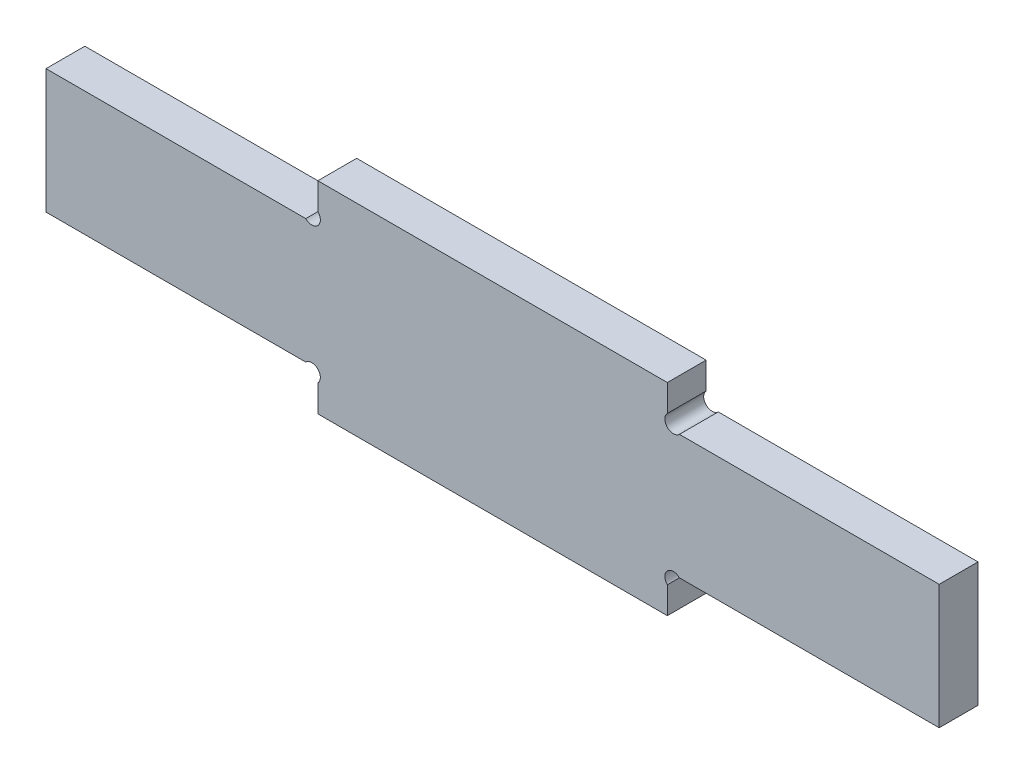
ISO-10303-21;
HEADER;
FILE_DESCRIPTION(('STEP AP214'),'2;1');
FILE_NAME('part.step','',(''),(''),'','','');
FILE_SCHEMA(('AUTOMOTIVE_DESIGN { 1 0 10303 214 1 1 1 1 }'));
ENDSEC;
DATA;
#1=APPLICATION_CONTEXT('core data for automotive mechanical design processes');
#2=APPLICATION_PROTOCOL_DEFINITION('international standard','automotive_design',2000,#1);
#3=PRODUCT_CONTEXT('',#1,'mechanical');
#4=PRODUCT('Part','Part','',(#3));
#5=PRODUCT_RELATED_PRODUCT_CATEGORY('part','',(#4));
#6=PRODUCT_DEFINITION_FORMATION('','',#4);
#7=PRODUCT_DEFINITION_CONTEXT('part definition',#1,'design');
#8=PRODUCT_DEFINITION('design','',#6,#7);
#9=PRODUCT_DEFINITION_SHAPE('','',#8);
#10=(LENGTH_UNIT() NAMED_UNIT(*) SI_UNIT(.MILLI.,.METRE.));
#11=(NAMED_UNIT(*) PLANE_ANGLE_UNIT() SI_UNIT($,.RADIAN.));
#12=(NAMED_UNIT(*) SI_UNIT($,.STERADIAN.) SOLID_ANGLE_UNIT());
#13=UNCERTAINTY_MEASURE_WITH_UNIT(LENGTH_MEASURE(1.E-05),#10,'distance_accuracy_value','');
#14=(GEOMETRIC_REPRESENTATION_CONTEXT(3) GLOBAL_UNCERTAINTY_ASSIGNED_CONTEXT((#13)) GLOBAL_UNIT_ASSIGNED_CONTEXT((#10,
#11,#12)) REPRESENTATION_CONTEXT('',''));
#15=CARTESIAN_POINT('',(0.,0.,0.));
#16=DIRECTION('',(0.,0.,1.));
#17=DIRECTION('',(1.,0.,0.));
#18=AXIS2_PLACEMENT_3D('',#15,#16,#17);
#19=CARTESIAN_POINT('',(0.,26.,5.));
#20=DIRECTION('',(0.,0.,-1.));
#21=DIRECTION('',(-1.,0.,0.));
#22=AXIS2_PLACEMENT_3D('',#19,#20,#21);
#23=PLANE('',#22);
#24=DIRECTION('',(0.,1.,0.));
#25=VECTOR('',#24,1.);
#26=CARTESIAN_POINT('',(80.,0.,5.));
#27=LINE('',#26,#25);
#28=CARTESIAN_POINT('',(80.,0.,5.));
#29=VERTEX_POINT('',#28);
#30=CARTESIAN_POINT('',(80.,3.44436508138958,5.));
#31=VERTEX_POINT('',#30);
#32=EDGE_CURVE('E50',#29,#31,#27,.T.);
#33=ORIENTED_EDGE('',*,*,#32,.T.);
#34=CARTESIAN_POINT('',(80.7778174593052,4.22218254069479,5.));
#35=DIRECTION('',(0.,0.,-1.));
#36=DIRECTION('',(-1.,0.,0.));
#37=AXIS2_PLACEMENT_3D('',#34,#35,#36);
#38=CIRCLE('',#37,1.1);
#39=CARTESIAN_POINT('',(81.5556349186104,5.,5.));
#40=VERTEX_POINT('',#39);
#41=EDGE_CURVE('E161',#31,#40,#38,.T.);
#42=ORIENTED_EDGE('',*,*,#41,.T.);
#43=DIRECTION('',(1.,0.,0.));
#44=VECTOR('',#43,1.);
#45=CARTESIAN_POINT('',(115.,5.,5.));
#46=LINE('',#45,#44);
#47=CARTESIAN_POINT('',(115.,5.,5.));
#48=VERTEX_POINT('',#47);
#49=EDGE_CURVE('E170',#40,#48,#46,.T.);
#50=ORIENTED_EDGE('',*,*,#49,.T.);
#51=DIRECTION('',(0.,-1.,0.));
#52=VECTOR('',#51,1.);
#53=CARTESIAN_POINT('',(115.,0.,5.));
#54=LINE('',#53,#52);
#55=CARTESIAN_POINT('',(115.,21.,5.));
#56=VERTEX_POINT('',#55);
#57=EDGE_CURVE('E198',#56,#48,#54,.T.);
#58=ORIENTED_EDGE('',*,*,#57,.F.);
#59=DIRECTION('',(-1.,0.,0.));
#60=VECTOR('',#59,1.);
#61=CARTESIAN_POINT('',(115.,21.,5.));
#62=LINE('',#61,#60);
#63=CARTESIAN_POINT('',(81.5556349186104,21.,5.));
#64=VERTEX_POINT('',#63);
#65=EDGE_CURVE('E58',#56,#64,#62,.T.);
#66=ORIENTED_EDGE('',*,*,#65,.T.);
#67=CARTESIAN_POINT('',(80.7778174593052,21.7778174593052,5.));
#68=DIRECTION('',(0.,0.,-1.));
#69=DIRECTION('',(-1.,0.,0.));
#70=AXIS2_PLACEMENT_3D('',#67,#68,#69);
#71=CIRCLE('',#70,1.1);
#72=CARTESIAN_POINT('',(80.,22.5556349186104,5.));
#73=VERTEX_POINT('',#72);
#74=EDGE_CURVE('E174',#64,#73,#71,.T.);
#75=ORIENTED_EDGE('',*,*,#74,.T.);
#76=DIRECTION('',(0.,1.,0.));
#77=VECTOR('',#76,1.);
#78=CARTESIAN_POINT('',(80.,26.,5.));
#79=LINE('',#78,#77);
#80=CARTESIAN_POINT('',(80.,26.,5.));
#81=VERTEX_POINT('',#80);
#82=EDGE_CURVE('E189',#73,#81,#79,.T.);
#83=ORIENTED_EDGE('',*,*,#82,.T.);
#84=DIRECTION('',(-1.,0.,0.));
#85=VECTOR('',#84,1.);
#86=CARTESIAN_POINT('',(0.,26.,5.));
#87=LINE('',#86,#85);
#88=CARTESIAN_POINT('',(35.,26.,5.));
#89=VERTEX_POINT('',#88);
#90=EDGE_CURVE('E11',#81,#89,#87,.T.);
#91=ORIENTED_EDGE('',*,*,#90,.T.);
#92=DIRECTION('',(0.,1.,0.));
#93=VECTOR('',#92,1.);
#94=CARTESIAN_POINT('',(35.,26.,5.));
#95=LINE('',#94,#93);
#96=CARTESIAN_POINT('',(35.,22.5556349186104,5.));
#97=VERTEX_POINT('',#96);
#98=EDGE_CURVE('E241',#97,#89,#95,.T.);
#99=ORIENTED_EDGE('',*,*,#98,.F.);
#100=CARTESIAN_POINT('',(34.2221825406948,21.7778174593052,5.));
#101=DIRECTION('',(0.,0.,1.));
#102=DIRECTION('',(1.,0.,0.));
#103=AXIS2_PLACEMENT_3D('',#100,#101,#102);
#104=CIRCLE('',#103,1.1);
#105=CARTESIAN_POINT('',(33.4443650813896,21.,5.));
#106=VERTEX_POINT('',#105);
#107=EDGE_CURVE('E216',#106,#97,#104,.T.);
#108=ORIENTED_EDGE('',*,*,#107,.F.);
#109=DIRECTION('',(1.,0.,0.));
#110=VECTOR('',#109,1.);
#111=CARTESIAN_POINT('',(0.,21.,5.));
#112=LINE('',#111,#110);
#113=CARTESIAN_POINT('',(0.,21.,5.));
#114=VERTEX_POINT('',#113);
#115=EDGE_CURVE('E238',#114,#106,#112,.T.);
#116=ORIENTED_EDGE('',*,*,#115,.F.);
#117=DIRECTION('',(0.,-1.,0.));
#118=VECTOR('',#117,1.);
#119=CARTESIAN_POINT('',(0.,0.,5.));
#120=LINE('',#119,#118);
#121=CARTESIAN_POINT('',(0.,5.,5.));
#122=VERTEX_POINT('',#121);
#123=EDGE_CURVE('E253',#114,#122,#120,.T.);
#124=ORIENTED_EDGE('',*,*,#123,.T.);
#125=DIRECTION('',(-1.,0.,0.));
#126=VECTOR('',#125,1.);
#127=CARTESIAN_POINT('',(0.,5.,5.));
#128=LINE('',#127,#126);
#129=CARTESIAN_POINT('',(33.4443650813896,5.,5.));
#130=VERTEX_POINT('',#129);
#131=EDGE_CURVE('E228',#130,#122,#128,.T.);
#132=ORIENTED_EDGE('',*,*,#131,.F.);
#133=CARTESIAN_POINT('',(34.2221825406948,4.22218254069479,5.));
#134=DIRECTION('',(0.,0.,1.));
#135=DIRECTION('',(1.,0.,0.));
#136=AXIS2_PLACEMENT_3D('',#133,#134,#135);
#137=CIRCLE('',#136,1.1);
#138=CARTESIAN_POINT('',(35.,3.44436508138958,5.));
#139=VERTEX_POINT('',#138);
#140=EDGE_CURVE('E210',#139,#130,#137,.T.);
#141=ORIENTED_EDGE('',*,*,#140,.F.);
#142=DIRECTION('',(0.,1.,0.));
#143=VECTOR('',#142,1.);
#144=CARTESIAN_POINT('',(35.,0.,5.));
#145=LINE('',#144,#143);
#146=CARTESIAN_POINT('',(35.,0.,5.));
#147=VERTEX_POINT('',#146);
#148=EDGE_CURVE('E225',#147,#139,#145,.T.);
#149=ORIENTED_EDGE('',*,*,#148,.F.);
#150=DIRECTION('',(1.,0.,0.));
#151=VECTOR('',#150,1.);
#152=CARTESIAN_POINT('',(0.,0.,5.));
#153=LINE('',#152,#151);
#154=EDGE_CURVE('E42',#147,#29,#153,.T.);
#155=ORIENTED_EDGE('',*,*,#154,.T.);
#156=EDGE_LOOP('',(#33,#42,#50,#58,#66,#75,#83,#91,#99,#108,#116,#124,#132,#141,#149,#155));
#157=FACE_BOUND('',#156,.T.);
#158=ADVANCED_FACE('F33',(#157),#23,.F.);
#159=CARTESIAN_POINT('',(0.,26.,0.));
#160=DIRECTION('',(0.,0.,-1.));
#161=DIRECTION('',(-1.,0.,0.));
#162=AXIS2_PLACEMENT_3D('',#159,#160,#161);
#163=PLANE('',#162);
#164=CARTESIAN_POINT('',(80.7778174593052,4.22218254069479,0.));
#165=DIRECTION('',(0.,0.,-1.));
#166=DIRECTION('',(-1.,0.,0.));
#167=AXIS2_PLACEMENT_3D('',#164,#165,#166);
#168=CIRCLE('',#167,1.1);
#169=CARTESIAN_POINT('',(80.,3.44436508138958,0.));
#170=VERTEX_POINT('',#169);
#171=CARTESIAN_POINT('',(81.5556349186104,5.,0.));
#172=VERTEX_POINT('',#171);
#173=EDGE_CURVE('E149',#170,#172,#168,.T.);
#174=ORIENTED_EDGE('',*,*,#173,.F.);
#175=DIRECTION('',(0.,1.,0.));
#176=VECTOR('',#175,1.);
#177=CARTESIAN_POINT('',(80.,0.,0.));
#178=LINE('',#177,#176);
#179=CARTESIAN_POINT('',(80.,0.,0.));
#180=VERTEX_POINT('',#179);
#181=EDGE_CURVE('E154',#180,#170,#178,.T.);
#182=ORIENTED_EDGE('',*,*,#181,.F.);
#183=DIRECTION('',(1.,0.,0.));
#184=VECTOR('',#183,1.);
#185=CARTESIAN_POINT('',(0.,0.,0.));
#186=LINE('',#185,#184);
#187=CARTESIAN_POINT('',(35.,0.,0.));
#188=VERTEX_POINT('',#187);
#189=EDGE_CURVE('E259',#188,#180,#186,.T.);
#190=ORIENTED_EDGE('',*,*,#189,.F.);
#191=DIRECTION('',(0.,1.,0.));
#192=VECTOR('',#191,1.);
#193=CARTESIAN_POINT('',(35.,0.,0.));
#194=LINE('',#193,#192);
#195=CARTESIAN_POINT('',(35.,3.44436508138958,0.));
#196=VERTEX_POINT('',#195);
#197=EDGE_CURVE('E220',#188,#196,#194,.T.);
#198=ORIENTED_EDGE('',*,*,#197,.T.);
#199=CARTESIAN_POINT('',(34.2221825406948,4.22218254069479,0.));
#200=DIRECTION('',(0.,0.,-1.));
#201=DIRECTION('',(-1.,0.,0.));
#202=AXIS2_PLACEMENT_3D('',#199,#200,#201);
#203=CIRCLE('',#202,1.1);
#204=CARTESIAN_POINT('',(33.4443650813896,5.,0.));
#205=VERTEX_POINT('',#204);
#206=EDGE_CURVE('E212',#196,#205,#203,.F.);
#207=ORIENTED_EDGE('',*,*,#206,.T.);
#208=DIRECTION('',(-1.,0.,0.));
#209=VECTOR('',#208,1.);
#210=CARTESIAN_POINT('',(0.,5.,0.));
#211=LINE('',#210,#209);
#212=CARTESIAN_POINT('',(0.,5.,0.));
#213=VERTEX_POINT('',#212);
#214=EDGE_CURVE('E223',#205,#213,#211,.T.);
#215=ORIENTED_EDGE('',*,*,#214,.T.);
#216=DIRECTION('',(0.,-1.,0.));
#217=VECTOR('',#216,1.);
#218=CARTESIAN_POINT('',(0.,0.,0.));
#219=LINE('',#218,#217);
#220=CARTESIAN_POINT('',(0.,21.,0.));
#221=VERTEX_POINT('',#220);
#222=EDGE_CURVE('E252',#221,#213,#219,.T.);
#223=ORIENTED_EDGE('',*,*,#222,.F.);
#224=DIRECTION('',(1.,0.,0.));
#225=VECTOR('',#224,1.);
#226=CARTESIAN_POINT('',(0.,21.,0.));
#227=LINE('',#226,#225);
#228=CARTESIAN_POINT('',(33.4443650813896,21.,0.));
#229=VERTEX_POINT('',#228);
#230=EDGE_CURVE('E248',#221,#229,#227,.T.);
#231=ORIENTED_EDGE('',*,*,#230,.T.);
#232=CARTESIAN_POINT('',(34.2221825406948,21.7778174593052,0.));
#233=DIRECTION('',(0.,0.,-1.));
#234=DIRECTION('',(-1.,0.,0.));
#235=AXIS2_PLACEMENT_3D('',#232,#233,#234);
#236=CIRCLE('',#235,1.1);
#237=CARTESIAN_POINT('',(35.,22.5556349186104,0.));
#238=VERTEX_POINT('',#237);
#239=EDGE_CURVE('E218',#229,#238,#236,.F.);
#240=ORIENTED_EDGE('',*,*,#239,.T.);
#241=DIRECTION('',(0.,1.,0.));
#242=VECTOR('',#241,1.);
#243=CARTESIAN_POINT('',(35.,26.,0.));
#244=LINE('',#243,#242);
#245=CARTESIAN_POINT('',(35.,26.,0.));
#246=VERTEX_POINT('',#245);
#247=EDGE_CURVE('E234',#238,#246,#244,.T.);
#248=ORIENTED_EDGE('',*,*,#247,.T.);
#249=DIRECTION('',(-1.,0.,0.));
#250=VECTOR('',#249,1.);
#251=CARTESIAN_POINT('',(0.,26.,0.));
#252=LINE('',#251,#250);
#253=CARTESIAN_POINT('',(80.,26.,0.));
#254=VERTEX_POINT('',#253);
#255=EDGE_CURVE('E37',#254,#246,#252,.T.);
#256=ORIENTED_EDGE('',*,*,#255,.F.);
#257=DIRECTION('',(0.,1.,0.));
#258=VECTOR('',#257,1.);
#259=CARTESIAN_POINT('',(80.,26.,0.));
#260=LINE('',#259,#258);
#261=CARTESIAN_POINT('',(80.,22.5556349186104,0.));
#262=VERTEX_POINT('',#261);
#263=EDGE_CURVE('E184',#262,#254,#260,.T.);
#264=ORIENTED_EDGE('',*,*,#263,.F.);
#265=CARTESIAN_POINT('',(80.7778174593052,21.7778174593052,0.));
#266=DIRECTION('',(0.,0.,-1.));
#267=DIRECTION('',(-1.,0.,0.));
#268=AXIS2_PLACEMENT_3D('',#265,#266,#267);
#269=CIRCLE('',#268,1.1);
#270=CARTESIAN_POINT('',(81.5556349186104,21.,0.));
#271=VERTEX_POINT('',#270);
#272=EDGE_CURVE('E171',#271,#262,#269,.T.);
#273=ORIENTED_EDGE('',*,*,#272,.F.);
#274=DIRECTION('',(-1.,0.,0.));
#275=VECTOR('',#274,1.);
#276=CARTESIAN_POINT('',(115.,21.,0.));
#277=LINE('',#276,#275);
#278=CARTESIAN_POINT('',(115.,21.,0.));
#279=VERTEX_POINT('',#278);
#280=EDGE_CURVE('E186',#279,#271,#277,.T.);
#281=ORIENTED_EDGE('',*,*,#280,.F.);
#282=DIRECTION('',(0.,-1.,0.));
#283=VECTOR('',#282,1.);
#284=CARTESIAN_POINT('',(115.,0.,0.));
#285=LINE('',#284,#283);
#286=CARTESIAN_POINT('',(115.,5.,0.));
#287=VERTEX_POINT('',#286);
#288=EDGE_CURVE('E195',#279,#287,#285,.T.);
#289=ORIENTED_EDGE('',*,*,#288,.T.);
#290=DIRECTION('',(1.,0.,0.));
#291=VECTOR('',#290,1.);
#292=CARTESIAN_POINT('',(115.,5.,0.));
#293=LINE('',#292,#291);
#294=EDGE_CURVE('E157',#172,#287,#293,.T.);
#295=ORIENTED_EDGE('',*,*,#294,.F.);
#296=EDGE_LOOP('',(#174,#182,#190,#198,#207,#215,#223,#231,#240,#248,#256,#264,#273,#281,#289,#295));
#297=FACE_BOUND('',#296,.T.);
#298=ADVANCED_FACE('F151',(#297),#163,.T.);
#299=CARTESIAN_POINT('',(80.,0.,-0.00100000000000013));
#300=DIRECTION('',(1.,0.,0.));
#301=DIRECTION('',(0.,0.,-1.));
#302=AXIS2_PLACEMENT_3D('',#299,#300,#301);
#303=PLANE('',#302);
#304=ORIENTED_EDGE('',*,*,#181,.T.);
#305=DIRECTION('',(0.,0.,1.));
#306=VECTOR('',#305,1.);
#307=CARTESIAN_POINT('',(80.,3.44436508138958,-0.00100000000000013));
#308=LINE('',#307,#306);
#309=EDGE_CURVE('E163',#31,#170,#308,.F.);
#310=ORIENTED_EDGE('',*,*,#309,.F.);
#311=ORIENTED_EDGE('',*,*,#32,.F.);
#312=DIRECTION('',(0.,0.,1.));
#313=VECTOR('',#312,1.);
#314=CARTESIAN_POINT('',(80.,0.,-0.00100000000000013));
#315=LINE('',#314,#313);
#316=EDGE_CURVE('E169',#180,#29,#315,.T.);
#317=ORIENTED_EDGE('',*,*,#316,.F.);
#318=EDGE_LOOP('',(#304,#310,#311,#317));
#319=FACE_BOUND('',#318,.T.);
#320=ADVANCED_FACE('F168',(#319),#303,.T.);
#321=CARTESIAN_POINT('',(115.,21.,-0.00100000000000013));
#322=DIRECTION('',(0.,1.,0.));
#323=DIRECTION('',(0.,0.,1.));
#324=AXIS2_PLACEMENT_3D('',#321,#322,#323);
#325=PLANE('',#324);
#326=ORIENTED_EDGE('',*,*,#280,.T.);
#327=DIRECTION('',(0.,0.,1.));
#328=VECTOR('',#327,1.);
#329=CARTESIAN_POINT('',(81.5556349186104,21.,-0.00100000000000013));
#330=LINE('',#329,#328);
#331=EDGE_CURVE('E166',#64,#271,#330,.F.);
#332=ORIENTED_EDGE('',*,*,#331,.F.);
#333=ORIENTED_EDGE('',*,*,#65,.F.);
#334=DIRECTION('',(0.,0.,1.));
#335=VECTOR('',#334,1.);
#336=CARTESIAN_POINT('',(115.,21.,-0.00100000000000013));
#337=LINE('',#336,#335);
#338=EDGE_CURVE('E193',#279,#56,#337,.T.);
#339=ORIENTED_EDGE('',*,*,#338,.F.);
#340=EDGE_LOOP('',(#326,#332,#333,#339));
#341=FACE_BOUND('',#340,.T.);
#342=ADVANCED_FACE('F289',(#341),#325,.T.);
#343=CARTESIAN_POINT('',(115.,5.,-0.00100000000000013));
#344=DIRECTION('',(0.,-1.,0.));
#345=DIRECTION('',(0.,0.,-1.));
#346=AXIS2_PLACEMENT_3D('',#343,#344,#345);
#347=PLANE('',#346);
#348=ORIENTED_EDGE('',*,*,#49,.F.);
#349=DIRECTION('',(0.,0.,1.));
#350=VECTOR('',#349,1.);
#351=CARTESIAN_POINT('',(81.5556349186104,5.,-0.00100000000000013));
#352=LINE('',#351,#350);
#353=EDGE_CURVE('E287',#172,#40,#352,.T.);
#354=ORIENTED_EDGE('',*,*,#353,.F.);
#355=ORIENTED_EDGE('',*,*,#294,.T.);
#356=DIRECTION('',(0.,0.,1.));
#357=VECTOR('',#356,1.);
#358=CARTESIAN_POINT('',(115.,5.,-0.00100000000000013));
#359=LINE('',#358,#357);
#360=EDGE_CURVE('E179',#287,#48,#359,.T.);
#361=ORIENTED_EDGE('',*,*,#360,.T.);
#362=EDGE_LOOP('',(#348,#354,#355,#361));
#363=FACE_BOUND('',#362,.T.);
#364=ADVANCED_FACE('F296',(#363),#347,.T.);
#365=CARTESIAN_POINT('',(80.,26.,-0.00100000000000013));
#366=DIRECTION('',(1.,0.,0.));
#367=DIRECTION('',(0.,0.,-1.));
#368=AXIS2_PLACEMENT_3D('',#365,#366,#367);
#369=PLANE('',#368);
#370=ORIENTED_EDGE('',*,*,#82,.F.);
#371=DIRECTION('',(0.,0.,1.));
#372=VECTOR('',#371,1.);
#373=CARTESIAN_POINT('',(80.,22.5556349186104,-0.00100000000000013));
#374=LINE('',#373,#372);
#375=EDGE_CURVE('E160',#262,#73,#374,.T.);
#376=ORIENTED_EDGE('',*,*,#375,.F.);
#377=ORIENTED_EDGE('',*,*,#263,.T.);
#378=DIRECTION('',(0.,0.,1.));
#379=VECTOR('',#378,1.);
#380=CARTESIAN_POINT('',(80.,26.,-0.00100000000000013));
#381=LINE('',#380,#379);
#382=EDGE_CURVE('E192',#254,#81,#381,.T.);
#383=ORIENTED_EDGE('',*,*,#382,.T.);
#384=EDGE_LOOP('',(#370,#376,#377,#383));
#385=FACE_BOUND('',#384,.T.);
#386=ADVANCED_FACE('F281',(#385),#369,.T.);
#387=CARTESIAN_POINT('',(115.,0.,5.));
#388=DIRECTION('',(1.,0.,0.));
#389=DIRECTION('',(0.,0.,-1.));
#390=AXIS2_PLACEMENT_3D('',#387,#388,#389);
#391=PLANE('',#390);
#392=ORIENTED_EDGE('',*,*,#57,.T.);
#393=ORIENTED_EDGE('',*,*,#360,.F.);
#394=ORIENTED_EDGE('',*,*,#288,.F.);
#395=ORIENTED_EDGE('',*,*,#338,.T.);
#396=EDGE_LOOP('',(#392,#393,#394,#395));
#397=FACE_BOUND('',#396,.T.);
#398=ADVANCED_FACE('F292',(#397),#391,.T.);
#399=CARTESIAN_POINT('',(0.,0.,5.));
#400=DIRECTION('',(0.,1.,0.));
#401=DIRECTION('',(0.,0.,1.));
#402=AXIS2_PLACEMENT_3D('',#399,#400,#401);
#403=PLANE('',#402);
#404=ORIENTED_EDGE('',*,*,#316,.T.);
#405=ORIENTED_EDGE('',*,*,#154,.F.);
#406=DIRECTION('',(0.,0.,1.));
#407=VECTOR('',#406,1.);
#408=CARTESIAN_POINT('',(35.,0.,-0.00100000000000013));
#409=LINE('',#408,#407);
#410=EDGE_CURVE('E230',#188,#147,#409,.T.);
#411=ORIENTED_EDGE('',*,*,#410,.F.);
#412=ORIENTED_EDGE('',*,*,#189,.T.);
#413=EDGE_LOOP('',(#404,#405,#411,#412));
#414=FACE_BOUND('',#413,.T.);
#415=ADVANCED_FACE('F320',(#414),#403,.F.);
#416=CARTESIAN_POINT('',(0.,26.,5.));
#417=DIRECTION('',(0.,-1.,0.));
#418=DIRECTION('',(0.,0.,-1.));
#419=AXIS2_PLACEMENT_3D('',#416,#417,#418);
#420=PLANE('',#419);
#421=ORIENTED_EDGE('',*,*,#382,.F.);
#422=ORIENTED_EDGE('',*,*,#255,.T.);
#423=DIRECTION('',(0.,0.,1.));
#424=VECTOR('',#423,1.);
#425=CARTESIAN_POINT('',(35.,26.,-0.00100000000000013));
#426=LINE('',#425,#424);
#427=EDGE_CURVE('E245',#246,#89,#426,.T.);
#428=ORIENTED_EDGE('',*,*,#427,.T.);
#429=ORIENTED_EDGE('',*,*,#90,.F.);
#430=EDGE_LOOP('',(#421,#422,#428,#429));
#431=FACE_BOUND('',#430,.T.);
#432=ADVANCED_FACE('F265',(#431),#420,.F.);
#433=CARTESIAN_POINT('',(0.,0.,5.));
#434=DIRECTION('',(1.,0.,0.));
#435=DIRECTION('',(0.,0.,-1.));
#436=AXIS2_PLACEMENT_3D('',#433,#434,#435);
#437=PLANE('',#436);
#438=ORIENTED_EDGE('',*,*,#222,.T.);
#439=DIRECTION('',(0.,0.,1.));
#440=VECTOR('',#439,1.);
#441=CARTESIAN_POINT('',(0.,5.,-0.00100000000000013));
#442=LINE('',#441,#440);
#443=EDGE_CURVE('E231',#213,#122,#442,.T.);
#444=ORIENTED_EDGE('',*,*,#443,.T.);
#445=ORIENTED_EDGE('',*,*,#123,.F.);
#446=DIRECTION('',(0.,0.,1.));
#447=VECTOR('',#446,1.);
#448=CARTESIAN_POINT('',(0.,21.,-0.00100000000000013));
#449=LINE('',#448,#447);
#450=EDGE_CURVE('E244',#221,#114,#449,.T.);
#451=ORIENTED_EDGE('',*,*,#450,.F.);
#452=EDGE_LOOP('',(#438,#444,#445,#451));
#453=FACE_BOUND('',#452,.T.);
#454=ADVANCED_FACE('F35',(#453),#437,.F.);
#455=CARTESIAN_POINT('',(35.,26.,-0.00100000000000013));
#456=DIRECTION('',(1.,0.,0.));
#457=DIRECTION('',(0.,0.,-1.));
#458=AXIS2_PLACEMENT_3D('',#455,#456,#457);
#459=PLANE('',#458);
#460=ORIENTED_EDGE('',*,*,#247,.F.);
#461=DIRECTION('',(0.,0.,1.));
#462=VECTOR('',#461,1.);
#463=CARTESIAN_POINT('',(35.,22.5556349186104,-0.00100000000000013));
#464=LINE('',#463,#462);
#465=EDGE_CURVE('E205',#97,#238,#464,.F.);
#466=ORIENTED_EDGE('',*,*,#465,.F.);
#467=ORIENTED_EDGE('',*,*,#98,.T.);
#468=ORIENTED_EDGE('',*,*,#427,.F.);
#469=EDGE_LOOP('',(#460,#466,#467,#468));
#470=FACE_BOUND('',#469,.T.);
#471=ADVANCED_FACE('F272',(#470),#459,.F.);
#472=CARTESIAN_POINT('',(0.,21.,-0.00100000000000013));
#473=DIRECTION('',(0.,-1.,0.));
#474=DIRECTION('',(0.,0.,-1.));
#475=AXIS2_PLACEMENT_3D('',#472,#473,#474);
#476=PLANE('',#475);
#477=ORIENTED_EDGE('',*,*,#115,.T.);
#478=DIRECTION('',(0.,0.,1.));
#479=VECTOR('',#478,1.);
#480=CARTESIAN_POINT('',(33.4443650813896,21.,-0.00100000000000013));
#481=LINE('',#480,#479);
#482=EDGE_CURVE('E214',#229,#106,#481,.T.);
#483=ORIENTED_EDGE('',*,*,#482,.F.);
#484=ORIENTED_EDGE('',*,*,#230,.F.);
#485=ORIENTED_EDGE('',*,*,#450,.T.);
#486=EDGE_LOOP('',(#477,#483,#484,#485));
#487=FACE_BOUND('',#486,.T.);
#488=ADVANCED_FACE('F316',(#487),#476,.F.);
#489=CARTESIAN_POINT('',(0.,5.,-0.00100000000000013));
#490=DIRECTION('',(0.,1.,0.));
#491=DIRECTION('',(0.,0.,1.));
#492=AXIS2_PLACEMENT_3D('',#489,#490,#491);
#493=PLANE('',#492);
#494=ORIENTED_EDGE('',*,*,#214,.F.);
#495=DIRECTION('',(0.,0.,1.));
#496=VECTOR('',#495,1.);
#497=CARTESIAN_POINT('',(33.4443650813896,5.,-0.00100000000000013));
#498=LINE('',#497,#496);
#499=EDGE_CURVE('E201',#130,#205,#498,.F.);
#500=ORIENTED_EDGE('',*,*,#499,.F.);
#501=ORIENTED_EDGE('',*,*,#131,.T.);
#502=ORIENTED_EDGE('',*,*,#443,.F.);
#503=EDGE_LOOP('',(#494,#500,#501,#502));
#504=FACE_BOUND('',#503,.T.);
#505=ADVANCED_FACE('F340',(#504),#493,.F.);
#506=CARTESIAN_POINT('',(35.,0.,-0.00100000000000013));
#507=DIRECTION('',(1.,0.,0.));
#508=DIRECTION('',(0.,0.,-1.));
#509=AXIS2_PLACEMENT_3D('',#506,#507,#508);
#510=PLANE('',#509);
#511=ORIENTED_EDGE('',*,*,#148,.T.);
#512=DIRECTION('',(0.,0.,1.));
#513=VECTOR('',#512,1.);
#514=CARTESIAN_POINT('',(35.,3.44436508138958,-0.00100000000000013));
#515=LINE('',#514,#513);
#516=EDGE_CURVE('E208',#196,#139,#515,.T.);
#517=ORIENTED_EDGE('',*,*,#516,.F.);
#518=ORIENTED_EDGE('',*,*,#197,.F.);
#519=ORIENTED_EDGE('',*,*,#410,.T.);
#520=EDGE_LOOP('',(#511,#517,#518,#519));
#521=FACE_BOUND('',#520,.T.);
#522=ADVANCED_FACE('F332',(#521),#510,.F.);
#523=CARTESIAN_POINT('',(34.2221825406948,21.7778174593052,-0.00100000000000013));
#524=DIRECTION('',(0.,0.,1.));
#525=DIRECTION('',(1.,0.,0.));
#526=AXIS2_PLACEMENT_3D('',#523,#524,#525);
#527=CYLINDRICAL_SURFACE('',#526,1.1);
#528=ORIENTED_EDGE('',*,*,#107,.T.);
#529=ORIENTED_EDGE('',*,*,#465,.T.);
#530=ORIENTED_EDGE('',*,*,#239,.F.);
#531=ORIENTED_EDGE('',*,*,#482,.T.);
#532=EDGE_LOOP('',(#528,#529,#530,#531));
#533=FACE_BOUND('',#532,.T.);
#534=ADVANCED_FACE('F347',(#533),#527,.F.);
#535=CARTESIAN_POINT('',(34.2221825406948,4.22218254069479,-0.00100000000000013));
#536=DIRECTION('',(0.,0.,1.));
#537=DIRECTION('',(1.,0.,0.));
#538=AXIS2_PLACEMENT_3D('',#535,#536,#537);
#539=CYLINDRICAL_SURFACE('',#538,1.1);
#540=ORIENTED_EDGE('',*,*,#140,.T.);
#541=ORIENTED_EDGE('',*,*,#499,.T.);
#542=ORIENTED_EDGE('',*,*,#206,.F.);
#543=ORIENTED_EDGE('',*,*,#516,.T.);
#544=EDGE_LOOP('',(#540,#541,#542,#543));
#545=FACE_BOUND('',#544,.T.);
#546=ADVANCED_FACE('F338',(#545),#539,.F.);
#547=CARTESIAN_POINT('',(80.7778174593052,21.7778174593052,-0.00100000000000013));
#548=DIRECTION('',(0.,0.,1.));
#549=DIRECTION('',(1.,0.,0.));
#550=AXIS2_PLACEMENT_3D('',#547,#548,#549);
#551=CYLINDRICAL_SURFACE('',#550,1.1);
#552=ORIENTED_EDGE('',*,*,#375,.T.);
#553=ORIENTED_EDGE('',*,*,#74,.F.);
#554=ORIENTED_EDGE('',*,*,#331,.T.);
#555=ORIENTED_EDGE('',*,*,#272,.T.);
#556=EDGE_LOOP('',(#552,#553,#554,#555));
#557=FACE_BOUND('',#556,.T.);
#558=ADVANCED_FACE('F286',(#557),#551,.F.);
#559=CARTESIAN_POINT('',(80.7778174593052,4.22218254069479,-0.00100000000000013));
#560=DIRECTION('',(0.,0.,1.));
#561=DIRECTION('',(1.,0.,0.));
#562=AXIS2_PLACEMENT_3D('',#559,#560,#561);
#563=CYLINDRICAL_SURFACE('',#562,1.1);
#564=ORIENTED_EDGE('',*,*,#173,.T.);
#565=ORIENTED_EDGE('',*,*,#353,.T.);
#566=ORIENTED_EDGE('',*,*,#41,.F.);
#567=ORIENTED_EDGE('',*,*,#309,.T.);
#568=EDGE_LOOP('',(#564,#565,#566,#567));
#569=FACE_BOUND('',#568,.T.);
#570=ADVANCED_FACE('F164',(#569),#563,.F.);
#571=CLOSED_SHELL('',(#158,#298,#320,#342,#364,#386,#398,#415,#432,#454,#471,#488,#505,#522,
#534,#546,#558,#570));
#572=MANIFOLD_SOLID_BREP('B2',#571);
#573=ADVANCED_BREP_SHAPE_REPRESENTATION('',(#18,#572),#14);
#574=SHAPE_DEFINITION_REPRESENTATION(#9,#573);
ENDSEC;
END-ISO-10303-21;
